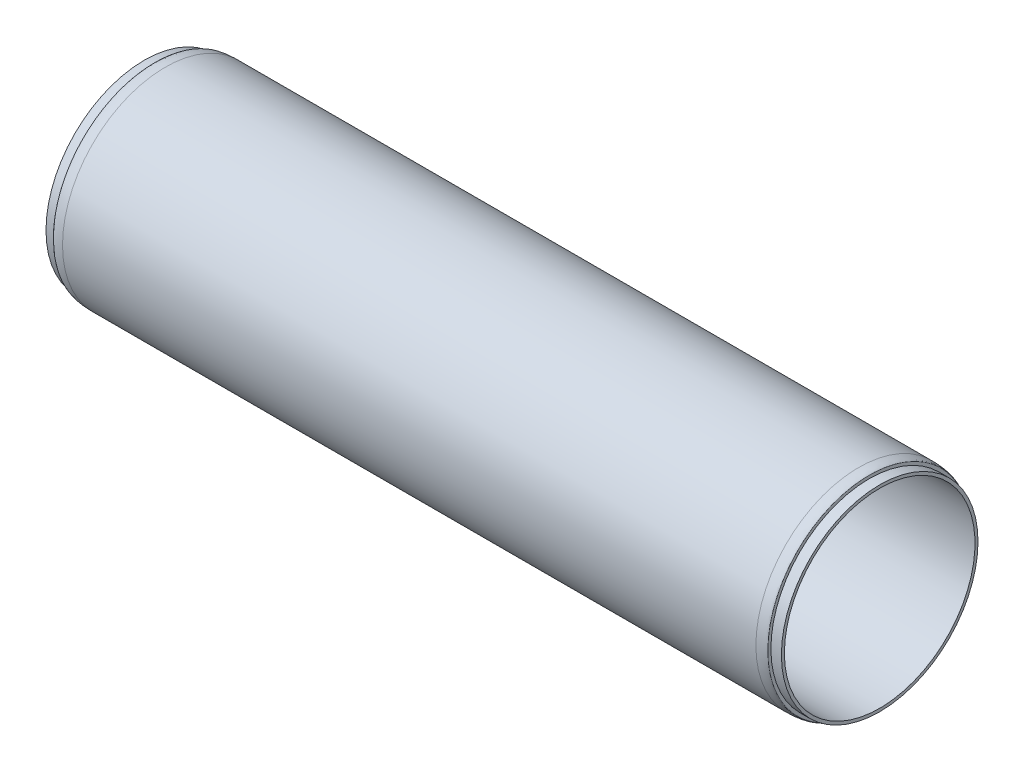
from build123d import *

# Parameters (mm, degrees)
SKETCH1_R           = 8.6995
SKETCH1_R_2         = 8.0645
EXTRUDE_THIN1_DEPTH = 62.23


with BuildPart() as part:
    # Sketch1 → Extrude-Thin1 (new body)
    with BuildSketch(Plane(origin=(0, 0, 0), x_dir=(0, 0, -1), z_dir=(1, 0, 0))):
        Circle(SKETCH1_R)
        Circle(SKETCH1_R_2, mode=Mode.SUBTRACT)
    extrude(amount=EXTRUDE_THIN1_DEPTH)

    # Sketch2 → Cut-Revolve1 (revolve, cut)
    with BuildSketch(Plane.XY, mode=Mode.PRIVATE) as cut_revolve1_sk:
        with BuildLine():
            Line((0, 8.6995), (1.778, 8.6995))
            add(Edge.make_bspline(
                [(1.778, 8.6995), (0.889, 8.6995), (0.889, 8.5725)],
                knots=[4.71238898, 4.71238898, 4.71238898, 6.283185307, 6.283185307, 6.283185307], degree=2, weights=[1, 0.707106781, 1]))
            Line((0.889, 8.5725), (0.889, 8.3185))
            Line((0.889, 8.3185), (0, 8.3185))
            Line((0, 8.3185), (0, 8.6995))
        make_face()
    cut_revolve1 = revolve(cut_revolve1_sk.sketch.rotate(Axis((62.23, 0, 0), (-1, 0, 0)), 270), axis=Axis((62.23, 0, 0), (-1, 0, 0)), mode=Mode.SUBTRACT)

    # Mirror1: Cut-Revolve1 across plane
    add(cut_revolve1.mirror(Plane(origin=(31.115, 0, 0), x_dir=(0, 0, 1), z_dir=(1, 0, 0))), mode=Mode.SUBTRACT)


solid = part.part
